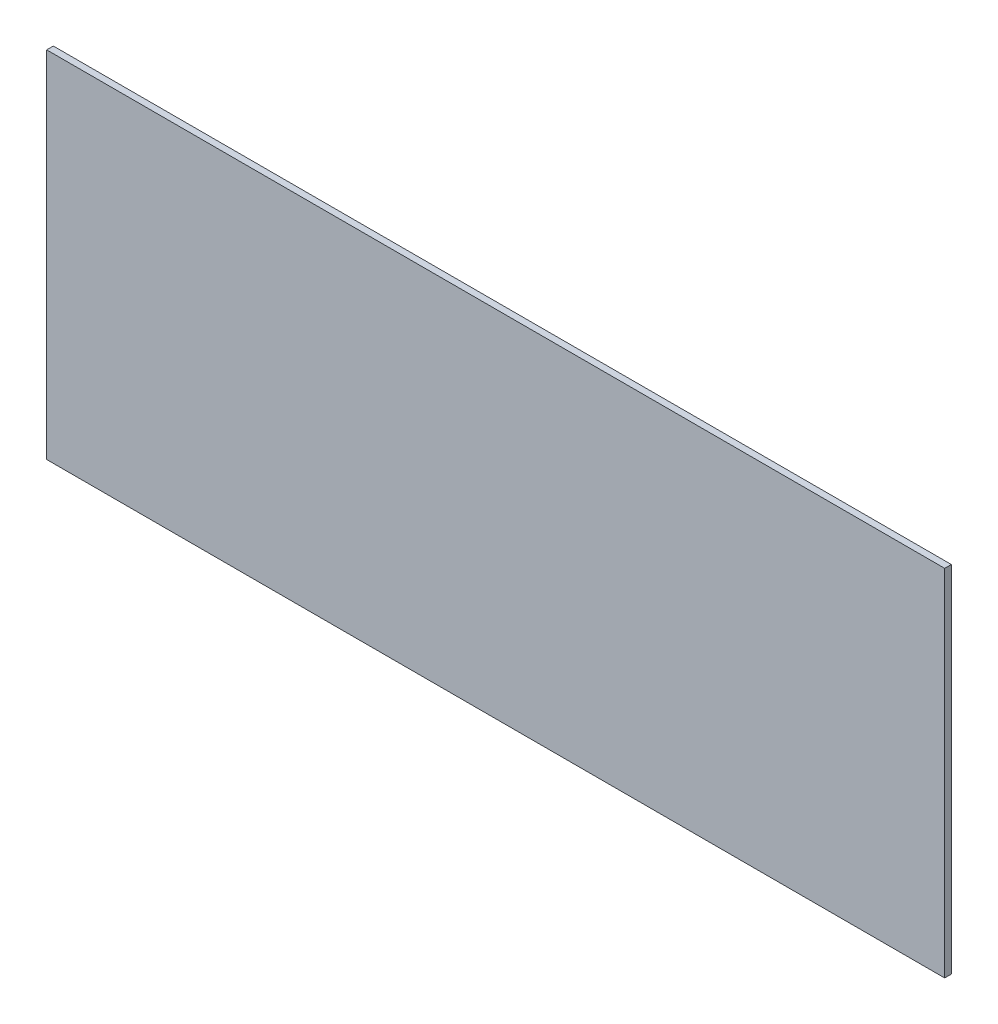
from build123d import *

# Parameters (mm, degrees)
CROQUIS1_W              = 405
CROQUIS1_H              = 160
SALIENTE_EXTRUIR1_DEPTH = 3


with BuildPart() as part:
    # Croquis1 → Saliente-Extruir1 (new body)
    with BuildSketch(Plane.XY):
        Rectangle(CROQUIS1_W, CROQUIS1_H)
    extrude(amount=SALIENTE_EXTRUIR1_DEPTH)


solid = part.part
